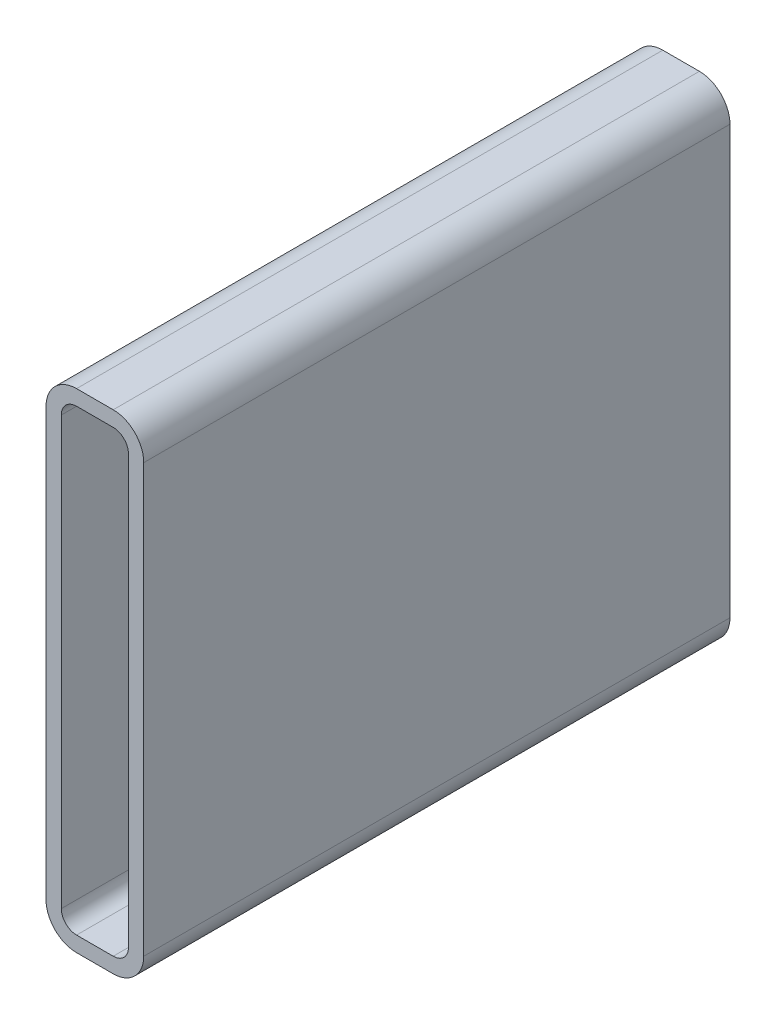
from build123d import *

# Parameters (mm, degrees)
BOSS_EXTRUDE1_DEPTH = 304.8


with BuildPart() as part:
    # Sketch1 → Boss-Extrude1 (new body)
    with BuildSketch(Plane.XY):
        with BuildLine():
            Line((15.875, 254), (34.925, 254))
            ThreePointArc((34.925, 254), (46.150320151, 249.350320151), (50.8, 238.125))
            Line((50.8, 238.125), (50.8, 15.875))
            ThreePointArc((50.8, 15.875), (46.150320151, 4.649679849), (34.925, 0))
            Line((34.925, 0), (15.875, 0))
            ThreePointArc((15.875, 0), (4.649679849, 4.649679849), (0, 15.875))
            Line((0, 15.875), (0, 238.125))
            ThreePointArc((0, 238.125), (4.649679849, 249.350320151), (15.875, 254))
        make_face()
        with BuildLine():
            Line((15.875, 246.0625), (34.925, 246.0625))
            ThreePointArc((34.925, 246.0625), (40.537660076, 243.737660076), (42.8625, 238.125))
            Line((42.8625, 238.125), (42.8625, 15.875))
            ThreePointArc((42.8625, 15.875), (40.537660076, 10.262339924), (34.925, 7.9375))
            Line((34.925, 7.9375), (15.875, 7.9375))
            ThreePointArc((15.875, 7.9375), (10.262339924, 10.262339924), (7.9375, 15.875))
            Line((7.9375, 15.875), (7.9375, 238.125))
            ThreePointArc((7.9375, 238.125), (10.262339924, 243.737660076), (15.875, 246.0625))
        make_face(mode=Mode.SUBTRACT)
    extrude(amount=BOSS_EXTRUDE1_DEPTH)


solid = part.part
